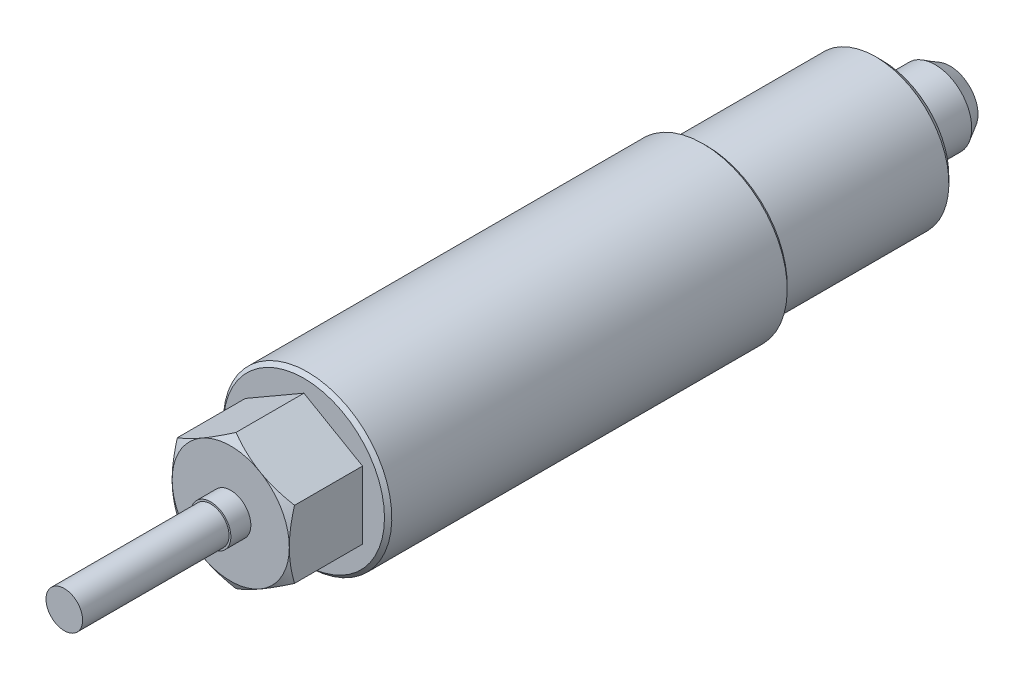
ISO-10303-21;
HEADER;
FILE_DESCRIPTION(('STEP AP214'),'2;1');
FILE_NAME('part.step','',(''),(''),'','','');
FILE_SCHEMA(('AUTOMOTIVE_DESIGN { 1 0 10303 214 1 1 1 1 }'));
ENDSEC;
DATA;
#1=APPLICATION_CONTEXT('core data for automotive mechanical design processes');
#2=APPLICATION_PROTOCOL_DEFINITION('international standard','automotive_design',2000,#1);
#3=PRODUCT_CONTEXT('',#1,'mechanical');
#4=PRODUCT('Part','Part','',(#3));
#5=PRODUCT_RELATED_PRODUCT_CATEGORY('part','',(#4));
#6=PRODUCT_DEFINITION_FORMATION('','',#4);
#7=PRODUCT_DEFINITION_CONTEXT('part definition',#1,'design');
#8=PRODUCT_DEFINITION('design','',#6,#7);
#9=PRODUCT_DEFINITION_SHAPE('','',#8);
#10=(LENGTH_UNIT() NAMED_UNIT(*) SI_UNIT(.MILLI.,.METRE.));
#11=(NAMED_UNIT(*) PLANE_ANGLE_UNIT() SI_UNIT($,.RADIAN.));
#12=(NAMED_UNIT(*) SI_UNIT($,.STERADIAN.) SOLID_ANGLE_UNIT());
#13=UNCERTAINTY_MEASURE_WITH_UNIT(LENGTH_MEASURE(1.E-05),#10,'distance_accuracy_value','');
#14=(GEOMETRIC_REPRESENTATION_CONTEXT(3) GLOBAL_UNCERTAINTY_ASSIGNED_CONTEXT((#13)) GLOBAL_UNIT_ASSIGNED_CONTEXT((#10,
#11,#12)) REPRESENTATION_CONTEXT('',''));
#15=CARTESIAN_POINT('',(0.,0.,0.));
#16=DIRECTION('',(0.,0.,1.));
#17=DIRECTION('',(1.,0.,0.));
#18=AXIS2_PLACEMENT_3D('',#15,#16,#17);
#19=CARTESIAN_POINT('',(0.,0.,79.));
#20=DIRECTION('',(0.,0.,-1.));
#21=DIRECTION('',(0.,1.,0.));
#22=AXIS2_PLACEMENT_3D('',#19,#20,#21);
#23=CONICAL_SURFACE('',#22,11.,0.785398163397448);
#24=CARTESIAN_POINT('',(0.,0.,78.5));
#25=DIRECTION('',(0.,0.,-1.));
#26=DIRECTION('',(0.,1.,0.));
#27=AXIS2_PLACEMENT_3D('',#24,#25,#26);
#28=CIRCLE('',#27,11.5);
#29=CARTESIAN_POINT('',(0.,11.5,78.5));
#30=VERTEX_POINT('',#29);
#31=EDGE_CURVE('E151',#30,#30,#28,.T.);
#32=ORIENTED_EDGE('',*,*,#31,.F.);
#33=EDGE_LOOP('',(#32));
#34=FACE_BOUND('',#33,.T.);
#35=CARTESIAN_POINT('',(0.,0.,79.));
#36=DIRECTION('',(0.,0.,1.));
#37=DIRECTION('',(0.,-1.,0.));
#38=AXIS2_PLACEMENT_3D('',#35,#36,#37);
#39=CIRCLE('',#38,11.);
#40=CARTESIAN_POINT('',(0.,-11.,79.));
#41=VERTEX_POINT('',#40);
#42=EDGE_CURVE('E120',#41,#41,#39,.T.);
#43=ORIENTED_EDGE('',*,*,#42,.F.);
#44=EDGE_LOOP('',(#43));
#45=FACE_BOUND('',#44,.T.);
#46=ADVANCED_FACE('F14',(#34,#45),#23,.T.);
#47=CARTESIAN_POINT('',(0.,0.,0.));
#48=DIRECTION('',(0.,0.,-1.));
#49=DIRECTION('',(0.,1.,0.));
#50=AXIS2_PLACEMENT_3D('',#47,#48,#49);
#51=CYLINDRICAL_SURFACE('',#50,11.5);
#52=CARTESIAN_POINT('',(0.,0.,24.5));
#53=DIRECTION('',(0.,0.,-1.));
#54=DIRECTION('',(0.,1.,0.));
#55=AXIS2_PLACEMENT_3D('',#52,#53,#54);
#56=CIRCLE('',#55,11.5);
#57=CARTESIAN_POINT('',(0.,11.5,24.5));
#58=VERTEX_POINT('',#57);
#59=EDGE_CURVE('E148',#58,#58,#56,.T.);
#60=ORIENTED_EDGE('',*,*,#59,.F.);
#61=EDGE_LOOP('',(#60));
#62=FACE_BOUND('',#61,.T.);
#63=ORIENTED_EDGE('',*,*,#31,.T.);
#64=EDGE_LOOP('',(#63));
#65=FACE_BOUND('',#64,.T.);
#66=ADVANCED_FACE('F218',(#62,#65),#51,.T.);
#67=CARTESIAN_POINT('',(0.,0.,24.5));
#68=DIRECTION('',(0.,0.,1.));
#69=DIRECTION('',(0.,-1.,0.));
#70=AXIS2_PLACEMENT_3D('',#67,#68,#69);
#71=CONICAL_SURFACE('',#70,11.5,0.785398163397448);
#72=CARTESIAN_POINT('',(0.,0.,24.));
#73=DIRECTION('',(0.,0.,-1.));
#74=DIRECTION('',(0.,1.,0.));
#75=AXIS2_PLACEMENT_3D('',#72,#73,#74);
#76=CIRCLE('',#75,11.);
#77=CARTESIAN_POINT('',(0.,11.,24.));
#78=VERTEX_POINT('',#77);
#79=EDGE_CURVE('E145',#78,#78,#76,.T.);
#80=ORIENTED_EDGE('',*,*,#79,.F.);
#81=EDGE_LOOP('',(#80));
#82=FACE_BOUND('',#81,.T.);
#83=ORIENTED_EDGE('',*,*,#59,.T.);
#84=EDGE_LOOP('',(#83));
#85=FACE_BOUND('',#84,.T.);
#86=ADVANCED_FACE('F214',(#82,#85),#71,.T.);
#87=CARTESIAN_POINT('',(11.,0.,24.));
#88=DIRECTION('',(0.,0.,1.));
#89=DIRECTION('',(0.,-1.,0.));
#90=AXIS2_PLACEMENT_3D('',#87,#88,#89);
#91=PLANE('',#90);
#92=CARTESIAN_POINT('',(0.,0.,24.));
#93=DIRECTION('',(0.,0.,-1.));
#94=DIRECTION('',(0.,1.,0.));
#95=AXIS2_PLACEMENT_3D('',#92,#93,#94);
#96=CIRCLE('',#95,10.);
#97=CARTESIAN_POINT('',(0.,10.,24.));
#98=VERTEX_POINT('',#97);
#99=EDGE_CURVE('E142',#98,#98,#96,.T.);
#100=ORIENTED_EDGE('',*,*,#99,.F.);
#101=EDGE_LOOP('',(#100));
#102=FACE_BOUND('',#101,.T.);
#103=ORIENTED_EDGE('',*,*,#79,.T.);
#104=EDGE_LOOP('',(#103));
#105=FACE_BOUND('',#104,.T.);
#106=ADVANCED_FACE('F211',(#102,#105),#91,.F.);
#107=CARTESIAN_POINT('',(-8.,4.61880215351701,79.));
#108=DIRECTION('',(-1.,0.,0.));
#109=DIRECTION('',(0.,-1.,0.));
#110=AXIS2_PLACEMENT_3D('',#107,#108,#109);
#111=PLANE('',#110);
#112=CARTESIAN_POINT('',(-8.,12.5536073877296,85.0243648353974));
#113=CARTESIAN_POINT('',(-8.,12.202944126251,85.1950535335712));
#114=CARTESIAN_POINT('',(-8.,11.851491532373,85.3641476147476));
#115=CARTESIAN_POINT('',(-8.,11.1465884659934,85.6982525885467));
#116=CARTESIAN_POINT('',(-8.,10.7931377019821,85.8632628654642));
#117=CARTESIAN_POINT('',(-8.,10.0820673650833,86.189105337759));
#118=CARTESIAN_POINT('',(-8.,9.72443565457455,86.3499111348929));
#119=CARTESIAN_POINT('',(-8.,9.0063788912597,86.6651358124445));
#120=CARTESIAN_POINT('',(-8.,8.64595396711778,86.8195549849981));
#121=CARTESIAN_POINT('',(-8.,7.90953345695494,87.1253935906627));
#122=CARTESIAN_POINT('',(-8.,7.53342244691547,87.2765365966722));
#123=CARTESIAN_POINT('',(-8.,6.77685561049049,87.5677353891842));
#124=CARTESIAN_POINT('',(-8.,6.39639930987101,87.7077899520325));
#125=CARTESIAN_POINT('',(-8.,5.63119795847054,87.9732419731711));
#126=CARTESIAN_POINT('',(-8.,5.24646288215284,88.0986678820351));
#127=CARTESIAN_POINT('',(-8.,4.47148883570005,88.3309365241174));
#128=CARTESIAN_POINT('',(-8.,4.08125159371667,88.4377849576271));
#129=CARTESIAN_POINT('',(-8.,3.2971932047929,88.6272837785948));
#130=CARTESIAN_POINT('',(-8.,2.90340610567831,88.7100712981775));
#131=CARTESIAN_POINT('',(-8.,2.30902459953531,88.8127022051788));
#132=CARTESIAN_POINT('',(-8.,2.1102670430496,88.8433221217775));
#133=CARTESIAN_POINT('',(-8.,1.71171483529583,88.8967817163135));
#134=CARTESIAN_POINT('',(-8.,1.51192028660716,88.9196221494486));
#135=CARTESIAN_POINT('',(-8.,1.11423554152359,88.9567734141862));
#136=CARTESIAN_POINT('',(-8.,0.916355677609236,88.9711943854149));
#137=CARTESIAN_POINT('',(-8.,0.520162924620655,88.9916487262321));
#138=CARTESIAN_POINT('',(-8.,0.321850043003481,88.9976822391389));
#139=CARTESIAN_POINT('',(-8.,-0.0748530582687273,89.0012171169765));
#140=CARTESIAN_POINT('',(-8.,-0.273243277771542,88.9987184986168));
#141=CARTESIAN_POINT('',(-8.,-0.669738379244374,88.9852520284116));
#142=CARTESIAN_POINT('',(-8.,-0.867843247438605,88.9742837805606));
#143=CARTESIAN_POINT('',(-8.,-1.33957431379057,88.9383175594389));
#144=CARTESIAN_POINT('',(-8.,-1.61291917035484,88.9095444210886));
#145=CARTESIAN_POINT('',(-8.,-2.15766264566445,88.8374103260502));
#146=CARTESIAN_POINT('',(-8.,-2.42906101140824,88.7940475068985));
#147=CARTESIAN_POINT('',(-8.,-3.23998071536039,88.6443668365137));
#148=CARTESIAN_POINT('',(-8.,-3.77594268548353,88.5184813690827));
#149=CARTESIAN_POINT('',(-8.,-4.57753225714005,88.2991318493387));
#150=CARTESIAN_POINT('',(-8.,-4.84728942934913,88.2198813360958));
#151=CARTESIAN_POINT('',(-8.,-5.38418667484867,88.0528836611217));
#152=CARTESIAN_POINT('',(-8.,-5.65132672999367,87.9651364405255));
#153=CARTESIAN_POINT('',(-8.,-6.18306845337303,87.7825750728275));
#154=CARTESIAN_POINT('',(-8.,-6.4476708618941,87.6877630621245));
#155=CARTESIAN_POINT('',(-8.,-6.97466590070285,87.4922140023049));
#156=CARTESIAN_POINT('',(-8.,-7.23705856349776,87.3914770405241));
#157=CARTESIAN_POINT('',(-8.,-7.88051669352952,87.1374262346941));
#158=CARTESIAN_POINT('',(-8.,-8.26047059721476,86.9813014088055));
#159=CARTESIAN_POINT('',(-8.,-9.01691952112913,86.6608599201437));
#160=CARTESIAN_POINT('',(-8.,-9.39341427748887,86.4965426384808));
#161=CARTESIAN_POINT('',(-8.,-10.143629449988,86.1614403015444));
#162=CARTESIAN_POINT('',(-8.,-10.5173490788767,85.9906534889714));
#163=CARTESIAN_POINT('',(-8.,-11.262399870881,85.6439867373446));
#164=CARTESIAN_POINT('',(-8.,-11.6337310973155,85.4681069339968));
#165=CARTESIAN_POINT('',(-8.,-12.3748915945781,85.1120269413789));
#166=CARTESIAN_POINT('',(-8.,-12.7447183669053,84.931821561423));
#167=CARTESIAN_POINT('',(-8.,-13.482727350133,84.5680742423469));
#168=CARTESIAN_POINT('',(-8.,-13.8509095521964,84.3845322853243));
#169=CARTESIAN_POINT('',(-8.,-14.5858360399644,84.0147378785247));
#170=CARTESIAN_POINT('',(-8.,-14.9525805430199,83.8284858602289));
#171=CARTESIAN_POINT('',(-8.,-15.6849051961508,83.4537053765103));
#172=CARTESIAN_POINT('',(-8.,-16.0504853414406,83.2651769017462));
#173=CARTESIAN_POINT('',(-8.,-17.079769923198,82.7309870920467));
#174=CARTESIAN_POINT('',(-8.,-17.7423367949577,82.3831340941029));
#175=CARTESIAN_POINT('',(-8.,-19.0650363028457,81.6827725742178));
#176=CARTESIAN_POINT('',(-8.,-19.7251688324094,81.3302638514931));
#177=CARTESIAN_POINT('',(-8.,-21.0416810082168,80.6227203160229));
#178=CARTESIAN_POINT('',(-8.,-21.6980659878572,80.2676954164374));
#179=CARTESIAN_POINT('',(-8.,-23.0092915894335,79.554901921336));
#180=CARTESIAN_POINT('',(-8.,-23.6641323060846,79.1971335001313));
#181=CARTESIAN_POINT('',(-8.,-24.3184126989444,78.8383511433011));
#182=B_SPLINE_CURVE_WITH_KNOTS('',3,(#112,#113,#114,#115,#116,#117,#118,#119,#120,#121,#122,
#123,#124,#125,#126,#127,#128,#129,#130,#131,#132,#133,#134,#135,#136,#137,#138,#139,#140,#141,
#142,#143,#144,#145,#146,#147,#148,#149,#150,#151,#152,#153,#154,#155,#156,#157,#158,#159,#160,
#161,#162,#163,#164,#165,#166,#167,#168,#169,#170,#171,#172,#173,#174,#175,#176,#177,#178,#179,
#180,#181),.UNSPECIFIED.,.F.,.F.,(4,2,2,2,2,2,2,2,2,2,2,2,2,2,2,2,2,2,2,2,2,2,2,2,2,2,2,2,2,2,2,
2,2,2,4),(0.,1.17001110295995,2.3401975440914,3.51651067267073,4.69276993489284,
5.90866593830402,7.1246959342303,8.33832003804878,9.55157109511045,10.7577653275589,
11.3609441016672,11.9640643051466,12.5591069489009,13.1541394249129,13.7491707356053,
14.3442298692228,15.1683323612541,15.9925400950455,17.6418068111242,18.485205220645,
19.328609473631,20.1717597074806,21.0148975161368,22.2471030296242,23.4794017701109,
24.7120376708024,25.9446407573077,27.1788052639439,28.4129763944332,29.646953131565,
30.8809349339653,33.1258942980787,35.3709507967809,37.6096830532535,39.8482742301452),.UNSPECIFIED.);
#183=CARTESIAN_POINT('',(-8.,-4.61880215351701,88.2854688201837));
#184=VERTEX_POINT('',#183);
#185=CARTESIAN_POINT('',(-8.,0.,89.));
#186=VERTEX_POINT('',#185);
#187=EDGE_CURVE('E9',#184,#186,#182,.F.);
#188=ORIENTED_EDGE('',*,*,#187,.T.);
#189=CARTESIAN_POINT('',(-8.,4.61880215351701,88.2854688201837));
#190=VERTEX_POINT('',#189);
#191=EDGE_CURVE('E18',#186,#190,#182,.F.);
#192=ORIENTED_EDGE('',*,*,#191,.T.);
#193=DIRECTION('',(0.,0.,1.));
#194=VECTOR('',#193,1.);
#195=CARTESIAN_POINT('',(-8.,4.61880215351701,79.));
#196=LINE('',#195,#194);
#197=CARTESIAN_POINT('',(-8.,4.61880215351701,79.));
#198=VERTEX_POINT('',#197);
#199=EDGE_CURVE('E111',#198,#190,#196,.T.);
#200=ORIENTED_EDGE('',*,*,#199,.F.);
#201=DIRECTION('',(0.,-1.,0.));
#202=VECTOR('',#201,1.);
#203=CARTESIAN_POINT('',(-8.,4.61880215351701,79.));
#204=LINE('',#203,#202);
#205=CARTESIAN_POINT('',(-8.,-4.61880215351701,79.));
#206=VERTEX_POINT('',#205);
#207=EDGE_CURVE('E97',#198,#206,#204,.T.);
#208=ORIENTED_EDGE('',*,*,#207,.T.);
#209=DIRECTION('',(0.,0.,1.));
#210=VECTOR('',#209,1.);
#211=CARTESIAN_POINT('',(-8.,-4.61880215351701,79.));
#212=LINE('',#211,#210);
#213=EDGE_CURVE('E89',#206,#184,#212,.T.);
#214=ORIENTED_EDGE('',*,*,#213,.T.);
#215=EDGE_LOOP('',(#188,#192,#200,#208,#214));
#216=FACE_BOUND('',#215,.T.);
#217=ADVANCED_FACE('F110',(#216),#111,.T.);
#218=CARTESIAN_POINT('',(0.,9.23760430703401,79.));
#219=DIRECTION('',(-0.5,0.866025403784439,0.));
#220=DIRECTION('',(-0.866025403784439,-0.5,0.));
#221=AXIS2_PLACEMENT_3D('',#218,#219,#220);
#222=PLANE('',#221);
#223=CARTESIAN_POINT('',(-8.0002,4.61868668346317,88.285402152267));
#224=CARTESIAN_POINT('',(-7.82435121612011,4.72021302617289,88.3440092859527));
#225=CARTESIAN_POINT('',(-7.64784680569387,4.82211789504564,88.3999565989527));
#226=CARTESIAN_POINT('',(-7.29340453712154,5.02675523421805,88.5057989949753));
#227=CARTESIAN_POINT('',(-7.11546609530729,5.12948804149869,88.5556914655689));
#228=CARTESIAN_POINT('',(-6.57880176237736,5.43933133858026,88.6953072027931));
#229=CARTESIAN_POINT('',(-6.21795741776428,5.64766491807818,88.7747188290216));
#230=CARTESIAN_POINT('',(-5.67796082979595,5.95943209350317,88.8678383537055));
#231=CARTESIAN_POINT('',(-5.50042181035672,6.06193429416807,88.8943654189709));
#232=CARTESIAN_POINT('',(-5.1445408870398,6.26740224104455,88.9388468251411));
#233=CARTESIAN_POINT('',(-4.96619905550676,6.37036794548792,88.9568019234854));
#234=CARTESIAN_POINT('',(-4.60920831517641,6.57647664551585,88.9836843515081));
#235=CARTESIAN_POINT('',(-4.4305599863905,6.67961930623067,88.9926219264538));
#236=CARTESIAN_POINT('',(-4.07309829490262,6.88599991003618,89.0012776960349));
#237=CARTESIAN_POINT('',(-3.89428493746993,6.98923785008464,89.0009961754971));
#238=CARTESIAN_POINT('',(-3.55998663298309,7.18224506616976,88.9918549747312));
#239=CARTESIAN_POINT('',(-3.40447809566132,7.27202796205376,88.9841103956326));
#240=CARTESIAN_POINT('',(-3.09382523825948,7.45138347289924,88.9617988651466));
#241=CARTESIAN_POINT('',(-2.93868094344,7.54095607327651,88.9472314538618));
#242=CARTESIAN_POINT('',(-2.47384868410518,7.80932710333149,88.8936393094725));
#243=CARTESIAN_POINT('',(-2.16498351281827,7.98765049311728,88.8447313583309));
#244=CARTESIAN_POINT('',(-1.5439767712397,8.34618890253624,88.7224605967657));
#245=CARTESIAN_POINT('',(-1.23191445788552,8.52635816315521,88.648579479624));
#246=CARTESIAN_POINT('',(-0.612443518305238,8.88400987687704,88.480899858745));
#247=CARTESIAN_POINT('',(-0.305026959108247,9.06149691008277,88.3871407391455));
#248=CARTESIAN_POINT('',(0.000199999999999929,9.23771977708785,88.285402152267));
#249=B_SPLINE_CURVE_WITH_KNOTS('',3,(#223,#224,#225,#226,#227,#228,#229,#230,#231,#232,#233,
#234,#235,#236,#237,#238,#239,#240,#241,#242,#243,#244,#245,#246,#247,#248),.UNSPECIFIED.,.F.,
.F.,(4,2,2,2,2,2,2,2,2,2,2,2,4),(0.,0.633973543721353,1.26821965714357,2.53934712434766,
3.15934343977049,3.77928496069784,4.39852133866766,5.01773858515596,5.5568023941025,
6.09590254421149,7.17487077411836,8.27776850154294,9.37850115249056),.UNSPECIFIED.);
#250=CARTESIAN_POINT('',(-4.,6.92820323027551,89.));
#251=VERTEX_POINT('',#250);
#252=EDGE_CURVE('E257',#190,#251,#249,.T.);
#253=ORIENTED_EDGE('',*,*,#252,.T.);
#254=CARTESIAN_POINT('',(0.,9.23760430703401,88.2854688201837));
#255=VERTEX_POINT('',#254);
#256=EDGE_CURVE('E251',#251,#255,#249,.T.);
#257=ORIENTED_EDGE('',*,*,#256,.T.);
#258=DIRECTION('',(0.,0.,1.));
#259=VECTOR('',#258,1.);
#260=CARTESIAN_POINT('',(0.,9.23760430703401,79.));
#261=LINE('',#260,#259);
#262=CARTESIAN_POINT('',(0.,9.23760430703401,79.));
#263=VERTEX_POINT('',#262);
#264=EDGE_CURVE('E121',#263,#255,#261,.T.);
#265=ORIENTED_EDGE('',*,*,#264,.F.);
#266=DIRECTION('',(-0.866025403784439,-0.5,0.));
#267=VECTOR('',#266,1.);
#268=CARTESIAN_POINT('',(0.,9.23760430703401,79.));
#269=LINE('',#268,#267);
#270=EDGE_CURVE('E113',#263,#198,#269,.T.);
#271=ORIENTED_EDGE('',*,*,#270,.T.);
#272=ORIENTED_EDGE('',*,*,#199,.T.);
#273=EDGE_LOOP('',(#253,#257,#265,#271,#272));
#274=FACE_BOUND('',#273,.T.);
#275=ADVANCED_FACE('F244',(#274),#222,.T.);
#276=CARTESIAN_POINT('',(8.,4.61880215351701,79.));
#277=DIRECTION('',(0.5,0.866025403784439,0.));
#278=DIRECTION('',(-0.866025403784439,0.5,0.));
#279=AXIS2_PLACEMENT_3D('',#276,#277,#278);
#280=PLANE('',#279);
#281=CARTESIAN_POINT('',(-0.0002,9.23771977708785,88.285402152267));
#282=CARTESIAN_POINT('',(0.175648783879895,9.13619343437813,88.3440092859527));
#283=CARTESIAN_POINT('',(0.352153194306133,9.03428856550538,88.3999565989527));
#284=CARTESIAN_POINT('',(0.706595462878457,8.82965122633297,88.5057989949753));
#285=CARTESIAN_POINT('',(0.884533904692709,8.72691841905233,88.5556914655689));
#286=CARTESIAN_POINT('',(1.42119823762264,8.41707512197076,88.6953072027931));
#287=CARTESIAN_POINT('',(1.78204258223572,8.20874154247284,88.7747188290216));
#288=CARTESIAN_POINT('',(2.32203917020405,7.89697436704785,88.8678383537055));
#289=CARTESIAN_POINT('',(2.49957818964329,7.79447216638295,88.8943654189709));
#290=CARTESIAN_POINT('',(2.8554591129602,7.58900421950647,88.9388468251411));
#291=CARTESIAN_POINT('',(3.03380094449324,7.4860385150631,88.9568019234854));
#292=CARTESIAN_POINT('',(3.3907916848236,7.27992981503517,88.9836843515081));
#293=CARTESIAN_POINT('',(3.56944001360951,7.17678715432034,88.9926219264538));
#294=CARTESIAN_POINT('',(3.92690170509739,6.97040655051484,89.0012776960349));
#295=CARTESIAN_POINT('',(4.10571506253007,6.86716861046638,89.0009961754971));
#296=CARTESIAN_POINT('',(4.44001336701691,6.67416139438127,88.9918549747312));
#297=CARTESIAN_POINT('',(4.59552190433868,6.58437849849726,88.9841103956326));
#298=CARTESIAN_POINT('',(4.90617476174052,6.40502298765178,88.9617988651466));
#299=CARTESIAN_POINT('',(5.06131905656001,6.31545038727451,88.9472314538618));
#300=CARTESIAN_POINT('',(5.52615131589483,6.04707935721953,88.8936393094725));
#301=CARTESIAN_POINT('',(5.83501648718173,5.86875596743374,88.8447313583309));
#302=CARTESIAN_POINT('',(6.45602322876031,5.51021755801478,88.7224605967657));
#303=CARTESIAN_POINT('',(6.76808554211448,5.33004829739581,88.648579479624));
#304=CARTESIAN_POINT('',(7.38755648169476,4.97239658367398,88.480899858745));
#305=CARTESIAN_POINT('',(7.69497304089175,4.79490955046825,88.3871407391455));
#306=CARTESIAN_POINT('',(8.0002,4.61868668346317,88.285402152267));
#307=B_SPLINE_CURVE_WITH_KNOTS('',3,(#281,#282,#283,#284,#285,#286,#287,#288,#289,#290,#291,
#292,#293,#294,#295,#296,#297,#298,#299,#300,#301,#302,#303,#304,#305,#306),.UNSPECIFIED.,.F.,
.F.,(4,2,2,2,2,2,2,2,2,2,2,2,4),(0.,0.633973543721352,1.26821965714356,2.53934712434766,
3.1593434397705,3.77928496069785,4.39852133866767,5.01773858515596,5.5568023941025,
6.09590254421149,7.17487077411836,8.27776850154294,9.37850115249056),.UNSPECIFIED.);
#308=CARTESIAN_POINT('',(4.,6.92820323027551,89.));
#309=VERTEX_POINT('',#308);
#310=EDGE_CURVE('E258',#255,#309,#307,.T.);
#311=ORIENTED_EDGE('',*,*,#310,.T.);
#312=CARTESIAN_POINT('',(8.,4.61880215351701,88.2854688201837));
#313=VERTEX_POINT('',#312);
#314=EDGE_CURVE('E259',#309,#313,#307,.T.);
#315=ORIENTED_EDGE('',*,*,#314,.T.);
#316=DIRECTION('',(0.,0.,1.));
#317=VECTOR('',#316,1.);
#318=CARTESIAN_POINT('',(8.,4.61880215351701,79.));
#319=LINE('',#318,#317);
#320=CARTESIAN_POINT('',(8.,4.61880215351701,79.));
#321=VERTEX_POINT('',#320);
#322=EDGE_CURVE('E124',#321,#313,#319,.T.);
#323=ORIENTED_EDGE('',*,*,#322,.F.);
#324=DIRECTION('',(-0.866025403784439,0.5,0.));
#325=VECTOR('',#324,1.);
#326=CARTESIAN_POINT('',(8.,4.61880215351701,79.));
#327=LINE('',#326,#325);
#328=EDGE_CURVE('E115',#321,#263,#327,.T.);
#329=ORIENTED_EDGE('',*,*,#328,.T.);
#330=ORIENTED_EDGE('',*,*,#264,.T.);
#331=EDGE_LOOP('',(#311,#315,#323,#329,#330));
#332=FACE_BOUND('',#331,.T.);
#333=ADVANCED_FACE('F248',(#332),#280,.T.);
#334=CARTESIAN_POINT('',(8.,-4.61880215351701,79.));
#335=DIRECTION('',(1.,0.,0.));
#336=DIRECTION('',(0.,1.,0.));
#337=AXIS2_PLACEMENT_3D('',#334,#335,#336);
#338=PLANE('',#337);
#339=CARTESIAN_POINT('',(8.,12.5536073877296,85.0243648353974));
#340=CARTESIAN_POINT('',(8.,12.202944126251,85.1950535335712));
#341=CARTESIAN_POINT('',(8.,11.851491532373,85.3641476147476));
#342=CARTESIAN_POINT('',(8.,11.1465884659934,85.6982525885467));
#343=CARTESIAN_POINT('',(8.,10.7931377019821,85.8632628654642));
#344=CARTESIAN_POINT('',(8.,10.0820673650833,86.189105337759));
#345=CARTESIAN_POINT('',(8.,9.72443565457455,86.3499111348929));
#346=CARTESIAN_POINT('',(8.,9.0063788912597,86.6651358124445));
#347=CARTESIAN_POINT('',(8.,8.64595396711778,86.8195549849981));
#348=CARTESIAN_POINT('',(8.,7.90953345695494,87.1253935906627));
#349=CARTESIAN_POINT('',(8.,7.53342244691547,87.2765365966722));
#350=CARTESIAN_POINT('',(8.,6.77685561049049,87.5677353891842));
#351=CARTESIAN_POINT('',(8.,6.39639930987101,87.7077899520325));
#352=CARTESIAN_POINT('',(8.,5.63119795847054,87.9732419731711));
#353=CARTESIAN_POINT('',(8.,5.24646288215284,88.0986678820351));
#354=CARTESIAN_POINT('',(8.,4.47148883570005,88.3309365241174));
#355=CARTESIAN_POINT('',(8.,4.08125159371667,88.4377849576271));
#356=CARTESIAN_POINT('',(8.,3.2971932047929,88.6272837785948));
#357=CARTESIAN_POINT('',(8.,2.90340610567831,88.7100712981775));
#358=CARTESIAN_POINT('',(8.,2.30902459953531,88.8127022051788));
#359=CARTESIAN_POINT('',(8.,2.1102670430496,88.8433221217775));
#360=CARTESIAN_POINT('',(8.,1.71171483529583,88.8967817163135));
#361=CARTESIAN_POINT('',(8.,1.51192028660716,88.9196221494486));
#362=CARTESIAN_POINT('',(8.,1.11423554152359,88.9567734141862));
#363=CARTESIAN_POINT('',(8.,0.916355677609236,88.9711943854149));
#364=CARTESIAN_POINT('',(8.,0.520162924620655,88.9916487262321));
#365=CARTESIAN_POINT('',(8.,0.321850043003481,88.9976822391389));
#366=CARTESIAN_POINT('',(8.,-0.0748530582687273,89.0012171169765));
#367=CARTESIAN_POINT('',(8.,-0.273243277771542,88.9987184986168));
#368=CARTESIAN_POINT('',(8.,-0.669738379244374,88.9852520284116));
#369=CARTESIAN_POINT('',(8.,-0.867843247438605,88.9742837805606));
#370=CARTESIAN_POINT('',(8.,-1.33957431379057,88.9383175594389));
#371=CARTESIAN_POINT('',(8.,-1.61291917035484,88.9095444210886));
#372=CARTESIAN_POINT('',(8.,-2.15766264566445,88.8374103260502));
#373=CARTESIAN_POINT('',(8.,-2.42906101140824,88.7940475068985));
#374=CARTESIAN_POINT('',(8.,-3.23998071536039,88.6443668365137));
#375=CARTESIAN_POINT('',(8.,-3.77594268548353,88.5184813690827));
#376=CARTESIAN_POINT('',(8.,-4.57753225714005,88.2991318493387));
#377=CARTESIAN_POINT('',(8.,-4.84728942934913,88.2198813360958));
#378=CARTESIAN_POINT('',(8.,-5.38418667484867,88.0528836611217));
#379=CARTESIAN_POINT('',(8.,-5.65132672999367,87.9651364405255));
#380=CARTESIAN_POINT('',(8.,-6.18306845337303,87.7825750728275));
#381=CARTESIAN_POINT('',(8.,-6.4476708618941,87.6877630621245));
#382=CARTESIAN_POINT('',(8.,-6.97466590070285,87.4922140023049));
#383=CARTESIAN_POINT('',(8.,-7.23705856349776,87.3914770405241));
#384=CARTESIAN_POINT('',(8.,-7.88051669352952,87.1374262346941));
#385=CARTESIAN_POINT('',(8.,-8.26047059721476,86.9813014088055));
#386=CARTESIAN_POINT('',(8.,-9.01691952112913,86.6608599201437));
#387=CARTESIAN_POINT('',(8.,-9.39341427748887,86.4965426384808));
#388=CARTESIAN_POINT('',(8.,-10.143629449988,86.1614403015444));
#389=CARTESIAN_POINT('',(8.,-10.5173490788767,85.9906534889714));
#390=CARTESIAN_POINT('',(8.,-11.262399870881,85.6439867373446));
#391=CARTESIAN_POINT('',(8.,-11.6337310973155,85.4681069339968));
#392=CARTESIAN_POINT('',(8.,-12.3748915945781,85.1120269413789));
#393=CARTESIAN_POINT('',(8.,-12.7447183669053,84.931821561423));
#394=CARTESIAN_POINT('',(8.,-13.482727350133,84.5680742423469));
#395=CARTESIAN_POINT('',(8.,-13.8509095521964,84.3845322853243));
#396=CARTESIAN_POINT('',(8.,-14.5858360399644,84.0147378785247));
#397=CARTESIAN_POINT('',(8.,-14.9525805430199,83.8284858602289));
#398=CARTESIAN_POINT('',(8.,-15.6849051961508,83.4537053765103));
#399=CARTESIAN_POINT('',(8.,-16.0504853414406,83.2651769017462));
#400=CARTESIAN_POINT('',(8.,-17.079769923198,82.7309870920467));
#401=CARTESIAN_POINT('',(8.,-17.7423367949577,82.3831340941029));
#402=CARTESIAN_POINT('',(8.,-19.0650363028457,81.6827725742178));
#403=CARTESIAN_POINT('',(8.,-19.7251688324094,81.3302638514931));
#404=CARTESIAN_POINT('',(8.,-21.0416810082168,80.6227203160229));
#405=CARTESIAN_POINT('',(8.,-21.6980659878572,80.2676954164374));
#406=CARTESIAN_POINT('',(8.,-23.0092915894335,79.554901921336));
#407=CARTESIAN_POINT('',(8.,-23.6641323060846,79.1971335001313));
#408=CARTESIAN_POINT('',(8.,-24.3184126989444,78.8383511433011));
#409=B_SPLINE_CURVE_WITH_KNOTS('',3,(#339,#340,#341,#342,#343,#344,#345,#346,#347,#348,#349,
#350,#351,#352,#353,#354,#355,#356,#357,#358,#359,#360,#361,#362,#363,#364,#365,#366,#367,#368,
#369,#370,#371,#372,#373,#374,#375,#376,#377,#378,#379,#380,#381,#382,#383,#384,#385,#386,#387,
#388,#389,#390,#391,#392,#393,#394,#395,#396,#397,#398,#399,#400,#401,#402,#403,#404,#405,#406,
#407,#408),.UNSPECIFIED.,.F.,.F.,(4,2,2,2,2,2,2,2,2,2,2,2,2,2,2,2,2,2,2,2,2,2,2,2,2,2,2,2,2,2,2,
2,2,2,4),(0.,1.17001110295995,2.3401975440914,3.51651067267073,4.69276993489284,
5.90866593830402,7.1246959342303,8.33832003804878,9.55157109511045,10.7577653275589,
11.3609441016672,11.9640643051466,12.5591069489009,13.1541394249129,13.7491707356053,
14.3442298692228,15.1683323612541,15.9925400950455,17.6418068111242,18.485205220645,
19.328609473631,20.1717597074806,21.0148975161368,22.2471030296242,23.4794017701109,
24.7120376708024,25.9446407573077,27.1788052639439,28.4129763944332,29.646953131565,
30.8809349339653,33.1258942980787,35.3709507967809,37.6096830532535,39.8482742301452),.UNSPECIFIED.);
#410=CARTESIAN_POINT('',(8.,0.,89.));
#411=VERTEX_POINT('',#410);
#412=EDGE_CURVE('E264',#313,#411,#409,.T.);
#413=ORIENTED_EDGE('',*,*,#412,.T.);
#414=CARTESIAN_POINT('',(8.,-4.61880215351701,88.2854688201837));
#415=VERTEX_POINT('',#414);
#416=EDGE_CURVE('E265',#411,#415,#409,.T.);
#417=ORIENTED_EDGE('',*,*,#416,.T.);
#418=DIRECTION('',(0.,0.,1.));
#419=VECTOR('',#418,1.);
#420=CARTESIAN_POINT('',(8.,-4.61880215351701,79.));
#421=LINE('',#420,#419);
#422=CARTESIAN_POINT('',(8.,-4.61880215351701,79.));
#423=VERTEX_POINT('',#422);
#424=EDGE_CURVE('E127',#423,#415,#421,.T.);
#425=ORIENTED_EDGE('',*,*,#424,.F.);
#426=DIRECTION('',(0.,1.,0.));
#427=VECTOR('',#426,1.);
#428=CARTESIAN_POINT('',(8.,-4.61880215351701,79.));
#429=LINE('',#428,#427);
#430=EDGE_CURVE('E319',#423,#321,#429,.T.);
#431=ORIENTED_EDGE('',*,*,#430,.T.);
#432=ORIENTED_EDGE('',*,*,#322,.T.);
#433=EDGE_LOOP('',(#413,#417,#425,#431,#432));
#434=FACE_BOUND('',#433,.T.);
#435=ADVANCED_FACE('F271',(#434),#338,.T.);
#436=CARTESIAN_POINT('',(0.,-9.23760430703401,79.));
#437=DIRECTION('',(0.5,-0.866025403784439,0.));
#438=DIRECTION('',(0.866025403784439,0.5,0.));
#439=AXIS2_PLACEMENT_3D('',#436,#437,#438);
#440=PLANE('',#439);
#441=CARTESIAN_POINT('',(8.0002,-4.61868668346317,88.285402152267));
#442=CARTESIAN_POINT('',(7.82435121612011,-4.72021302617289,88.3440092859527));
#443=CARTESIAN_POINT('',(7.64784680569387,-4.82211789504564,88.3999565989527));
#444=CARTESIAN_POINT('',(7.29340453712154,-5.02675523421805,88.5057989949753));
#445=CARTESIAN_POINT('',(7.11546609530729,-5.12948804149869,88.5556914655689));
#446=CARTESIAN_POINT('',(6.57880176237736,-5.43933133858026,88.6953072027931));
#447=CARTESIAN_POINT('',(6.21795741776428,-5.64766491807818,88.7747188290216));
#448=CARTESIAN_POINT('',(5.67796082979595,-5.95943209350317,88.8678383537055));
#449=CARTESIAN_POINT('',(5.50042181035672,-6.06193429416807,88.8943654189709));
#450=CARTESIAN_POINT('',(5.1445408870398,-6.26740224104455,88.9388468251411));
#451=CARTESIAN_POINT('',(4.96619905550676,-6.37036794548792,88.9568019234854));
#452=CARTESIAN_POINT('',(4.60920831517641,-6.57647664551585,88.9836843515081));
#453=CARTESIAN_POINT('',(4.4305599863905,-6.67961930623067,88.9926219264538));
#454=CARTESIAN_POINT('',(4.07309829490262,-6.88599991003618,89.0012776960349));
#455=CARTESIAN_POINT('',(3.89428493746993,-6.98923785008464,89.0009961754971));
#456=CARTESIAN_POINT('',(3.55998663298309,-7.18224506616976,88.9918549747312));
#457=CARTESIAN_POINT('',(3.40447809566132,-7.27202796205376,88.9841103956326));
#458=CARTESIAN_POINT('',(3.09382523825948,-7.45138347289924,88.9617988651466));
#459=CARTESIAN_POINT('',(2.93868094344,-7.54095607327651,88.9472314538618));
#460=CARTESIAN_POINT('',(2.47384868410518,-7.80932710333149,88.8936393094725));
#461=CARTESIAN_POINT('',(2.16498351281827,-7.98765049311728,88.8447313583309));
#462=CARTESIAN_POINT('',(1.5439767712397,-8.34618890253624,88.7224605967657));
#463=CARTESIAN_POINT('',(1.23191445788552,-8.52635816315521,88.648579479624));
#464=CARTESIAN_POINT('',(0.612443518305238,-8.88400987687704,88.480899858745));
#465=CARTESIAN_POINT('',(0.305026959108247,-9.06149691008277,88.3871407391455));
#466=CARTESIAN_POINT('',(-0.000199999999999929,-9.23771977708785,88.285402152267));
#467=B_SPLINE_CURVE_WITH_KNOTS('',3,(#441,#442,#443,#444,#445,#446,#447,#448,#449,#450,#451,
#452,#453,#454,#455,#456,#457,#458,#459,#460,#461,#462,#463,#464,#465,#466),.UNSPECIFIED.,.F.,
.F.,(4,2,2,2,2,2,2,2,2,2,2,2,4),(0.,0.633973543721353,1.26821965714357,2.53934712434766,
3.15934343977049,3.77928496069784,4.39852133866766,5.01773858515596,5.5568023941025,
6.09590254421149,7.17487077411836,8.27776850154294,9.37850115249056),.UNSPECIFIED.);
#468=CARTESIAN_POINT('',(4.,-6.92820323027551,89.));
#469=VERTEX_POINT('',#468);
#470=EDGE_CURVE('E270',#415,#469,#467,.T.);
#471=ORIENTED_EDGE('',*,*,#470,.T.);
#472=CARTESIAN_POINT('',(0.,-9.23760430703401,88.2854688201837));
#473=VERTEX_POINT('',#472);
#474=EDGE_CURVE('E177',#469,#473,#467,.T.);
#475=ORIENTED_EDGE('',*,*,#474,.T.);
#476=DIRECTION('',(0.,0.,1.));
#477=VECTOR('',#476,1.);
#478=CARTESIAN_POINT('',(0.,-9.23760430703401,79.));
#479=LINE('',#478,#477);
#480=CARTESIAN_POINT('',(0.,-9.23760430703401,79.));
#481=VERTEX_POINT('',#480);
#482=EDGE_CURVE('E96',#481,#473,#479,.T.);
#483=ORIENTED_EDGE('',*,*,#482,.F.);
#484=DIRECTION('',(0.866025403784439,0.5,0.));
#485=VECTOR('',#484,1.);
#486=CARTESIAN_POINT('',(0.,-9.23760430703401,79.));
#487=LINE('',#486,#485);
#488=EDGE_CURVE('E107',#481,#423,#487,.T.);
#489=ORIENTED_EDGE('',*,*,#488,.T.);
#490=ORIENTED_EDGE('',*,*,#424,.T.);
#491=EDGE_LOOP('',(#471,#475,#483,#489,#490));
#492=FACE_BOUND('',#491,.T.);
#493=ADVANCED_FACE('F191',(#492),#440,.T.);
#494=CARTESIAN_POINT('',(-8.,-4.61880215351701,79.));
#495=DIRECTION('',(-0.5,-0.866025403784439,0.));
#496=DIRECTION('',(0.866025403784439,-0.5,0.));
#497=AXIS2_PLACEMENT_3D('',#494,#495,#496);
#498=PLANE('',#497);
#499=CARTESIAN_POINT('',(0.0002,-9.23771977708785,88.285402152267));
#500=CARTESIAN_POINT('',(-0.175648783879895,-9.13619343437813,88.3440092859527));
#501=CARTESIAN_POINT('',(-0.352153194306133,-9.03428856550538,88.3999565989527));
#502=CARTESIAN_POINT('',(-0.706595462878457,-8.82965122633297,88.5057989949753));
#503=CARTESIAN_POINT('',(-0.884533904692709,-8.72691841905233,88.5556914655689));
#504=CARTESIAN_POINT('',(-1.42119823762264,-8.41707512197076,88.6953072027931));
#505=CARTESIAN_POINT('',(-1.78204258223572,-8.20874154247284,88.7747188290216));
#506=CARTESIAN_POINT('',(-2.32203917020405,-7.89697436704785,88.8678383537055));
#507=CARTESIAN_POINT('',(-2.49957818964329,-7.79447216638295,88.8943654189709));
#508=CARTESIAN_POINT('',(-2.8554591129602,-7.58900421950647,88.9388468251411));
#509=CARTESIAN_POINT('',(-3.03380094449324,-7.4860385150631,88.9568019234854));
#510=CARTESIAN_POINT('',(-3.3907916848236,-7.27992981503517,88.9836843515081));
#511=CARTESIAN_POINT('',(-3.56944001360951,-7.17678715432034,88.9926219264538));
#512=CARTESIAN_POINT('',(-3.92690170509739,-6.97040655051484,89.0012776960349));
#513=CARTESIAN_POINT('',(-4.10571506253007,-6.86716861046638,89.0009961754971));
#514=CARTESIAN_POINT('',(-4.44001336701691,-6.67416139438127,88.9918549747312));
#515=CARTESIAN_POINT('',(-4.59552190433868,-6.58437849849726,88.9841103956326));
#516=CARTESIAN_POINT('',(-4.90617476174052,-6.40502298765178,88.9617988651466));
#517=CARTESIAN_POINT('',(-5.06131905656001,-6.31545038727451,88.9472314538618));
#518=CARTESIAN_POINT('',(-5.52615131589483,-6.04707935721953,88.8936393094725));
#519=CARTESIAN_POINT('',(-5.83501648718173,-5.86875596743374,88.8447313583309));
#520=CARTESIAN_POINT('',(-6.45602322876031,-5.51021755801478,88.7224605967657));
#521=CARTESIAN_POINT('',(-6.76808554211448,-5.33004829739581,88.648579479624));
#522=CARTESIAN_POINT('',(-7.38755648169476,-4.97239658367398,88.480899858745));
#523=CARTESIAN_POINT('',(-7.69497304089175,-4.79490955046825,88.3871407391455));
#524=CARTESIAN_POINT('',(-8.0002,-4.61868668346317,88.285402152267));
#525=B_SPLINE_CURVE_WITH_KNOTS('',3,(#499,#500,#501,#502,#503,#504,#505,#506,#507,#508,#509,
#510,#511,#512,#513,#514,#515,#516,#517,#518,#519,#520,#521,#522,#523,#524),.UNSPECIFIED.,.F.,
.F.,(4,2,2,2,2,2,2,2,2,2,2,2,4),(0.,0.633973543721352,1.26821965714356,2.53934712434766,
3.1593434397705,3.77928496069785,4.39852133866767,5.01773858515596,5.5568023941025,
6.09590254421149,7.17487077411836,8.27776850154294,9.37850115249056),.UNSPECIFIED.);
#526=CARTESIAN_POINT('',(-4.,-6.92820323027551,89.));
#527=VERTEX_POINT('',#526);
#528=EDGE_CURVE('E35',#473,#527,#525,.T.);
#529=ORIENTED_EDGE('',*,*,#528,.T.);
#530=EDGE_CURVE('E93',#527,#184,#525,.T.);
#531=ORIENTED_EDGE('',*,*,#530,.T.);
#532=ORIENTED_EDGE('',*,*,#213,.F.);
#533=DIRECTION('',(0.866025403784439,-0.5,0.));
#534=VECTOR('',#533,1.);
#535=CARTESIAN_POINT('',(-8.,-4.61880215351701,79.));
#536=LINE('',#535,#534);
#537=EDGE_CURVE('E92',#206,#481,#536,.T.);
#538=ORIENTED_EDGE('',*,*,#537,.T.);
#539=ORIENTED_EDGE('',*,*,#482,.T.);
#540=EDGE_LOOP('',(#529,#531,#532,#538,#539));
#541=FACE_BOUND('',#540,.T.);
#542=ADVANCED_FACE('F91',(#541),#498,.T.);
#543=CARTESIAN_POINT('',(0.,0.,79.));
#544=DIRECTION('',(0.,0.,1.));
#545=DIRECTION('',(0.,-1.,0.));
#546=AXIS2_PLACEMENT_3D('',#543,#544,#545);
#547=PLANE('',#546);
#548=ORIENTED_EDGE('',*,*,#207,.F.);
#549=ORIENTED_EDGE('',*,*,#270,.F.);
#550=ORIENTED_EDGE('',*,*,#328,.F.);
#551=ORIENTED_EDGE('',*,*,#430,.F.);
#552=ORIENTED_EDGE('',*,*,#488,.F.);
#553=ORIENTED_EDGE('',*,*,#537,.F.);
#554=EDGE_LOOP('',(#548,#549,#550,#551,#552,#553));
#555=FACE_BOUND('',#554,.T.);
#556=ORIENTED_EDGE('',*,*,#42,.T.);
#557=EDGE_LOOP('',(#556));
#558=FACE_BOUND('',#557,.T.);
#559=ADVANCED_FACE('F102',(#555,#558),#547,.T.);
#560=CARTESIAN_POINT('',(0.,0.,111.73));
#561=DIRECTION('',(0.,0.,-1.));
#562=DIRECTION('',(0.,1.,0.));
#563=AXIS2_PLACEMENT_3D('',#560,#561,#562);
#564=PLANE('',#563);
#565=CARTESIAN_POINT('',(0.,0.,111.73));
#566=DIRECTION('',(0.,0.,-1.));
#567=DIRECTION('',(0.,1.,0.));
#568=AXIS2_PLACEMENT_3D('',#565,#566,#567);
#569=CIRCLE('',#568,2.5);
#570=CARTESIAN_POINT('',(0.,2.5,111.73));
#571=VERTEX_POINT('',#570);
#572=EDGE_CURVE('E168',#571,#571,#569,.T.);
#573=ORIENTED_EDGE('',*,*,#572,.F.);
#574=EDGE_LOOP('',(#573));
#575=FACE_BOUND('',#574,.T.);
#576=ADVANCED_FACE('F16',(#575),#564,.F.);
#577=CARTESIAN_POINT('',(0.,0.,0.));
#578=DIRECTION('',(0.,0.,-1.));
#579=DIRECTION('',(0.,1.,0.));
#580=AXIS2_PLACEMENT_3D('',#577,#578,#579);
#581=CYLINDRICAL_SURFACE('',#580,2.5);
#582=CARTESIAN_POINT('',(0.,0.,91.73));
#583=DIRECTION('',(0.,0.,-1.));
#584=DIRECTION('',(0.,1.,0.));
#585=AXIS2_PLACEMENT_3D('',#582,#583,#584);
#586=CIRCLE('',#585,2.5);
#587=CARTESIAN_POINT('',(0.,2.5,91.73));
#588=VERTEX_POINT('',#587);
#589=EDGE_CURVE('E165',#588,#588,#586,.T.);
#590=ORIENTED_EDGE('',*,*,#589,.F.);
#591=EDGE_LOOP('',(#590));
#592=FACE_BOUND('',#591,.T.);
#593=ORIENTED_EDGE('',*,*,#572,.T.);
#594=EDGE_LOOP('',(#593));
#595=FACE_BOUND('',#594,.T.);
#596=ADVANCED_FACE('F237',(#592,#595),#581,.T.);
#597=CARTESIAN_POINT('',(2.5,0.,91.73));
#598=DIRECTION('',(0.,0.,-1.));
#599=DIRECTION('',(0.,1.,0.));
#600=AXIS2_PLACEMENT_3D('',#597,#598,#599);
#601=PLANE('',#600);
#602=CARTESIAN_POINT('',(0.,0.,91.73));
#603=DIRECTION('',(0.,0.,-1.));
#604=DIRECTION('',(0.,1.,0.));
#605=AXIS2_PLACEMENT_3D('',#602,#603,#604);
#606=CIRCLE('',#605,2.75);
#607=CARTESIAN_POINT('',(0.,2.75,91.73));
#608=VERTEX_POINT('',#607);
#609=EDGE_CURVE('E162',#608,#608,#606,.T.);
#610=ORIENTED_EDGE('',*,*,#609,.F.);
#611=EDGE_LOOP('',(#610));
#612=FACE_BOUND('',#611,.T.);
#613=ORIENTED_EDGE('',*,*,#589,.T.);
#614=EDGE_LOOP('',(#613));
#615=FACE_BOUND('',#614,.T.);
#616=ADVANCED_FACE('F591',(#612,#615),#601,.F.);
#617=CARTESIAN_POINT('',(0.,0.,0.));
#618=DIRECTION('',(0.,0.,-1.));
#619=DIRECTION('',(0.,1.,0.));
#620=AXIS2_PLACEMENT_3D('',#617,#618,#619);
#621=CYLINDRICAL_SURFACE('',#620,2.75);
#622=CARTESIAN_POINT('',(0.,0.,89.));
#623=DIRECTION('',(0.,0.,-1.));
#624=DIRECTION('',(0.,1.,0.));
#625=AXIS2_PLACEMENT_3D('',#622,#623,#624);
#626=CIRCLE('',#625,2.75);
#627=CARTESIAN_POINT('',(0.,2.75,89.));
#628=VERTEX_POINT('',#627);
#629=EDGE_CURVE('E158',#628,#628,#626,.T.);
#630=ORIENTED_EDGE('',*,*,#629,.F.);
#631=EDGE_LOOP('',(#630));
#632=FACE_BOUND('',#631,.T.);
#633=ORIENTED_EDGE('',*,*,#609,.T.);
#634=EDGE_LOOP('',(#633));
#635=FACE_BOUND('',#634,.T.);
#636=ADVANCED_FACE('F584',(#632,#635),#621,.T.);
#637=CARTESIAN_POINT('',(0.,0.,89.));
#638=DIRECTION('',(0.,0.,-1.));
#639=DIRECTION('',(0.,1.,0.));
#640=AXIS2_PLACEMENT_3D('',#637,#638,#639);
#641=CONICAL_SURFACE('',#640,8.,1.0471975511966);
#642=ORIENTED_EDGE('',*,*,#416,.F.);
#643=CARTESIAN_POINT('',(0.,0.,89.));
#644=DIRECTION('',(0.,0.,-1.));
#645=DIRECTION('',(0.,1.,0.));
#646=AXIS2_PLACEMENT_3D('',#643,#644,#645);
#647=CIRCLE('',#646,8.);
#648=EDGE_CURVE('E155',#411,#469,#647,.T.);
#649=ORIENTED_EDGE('',*,*,#648,.T.);
#650=ORIENTED_EDGE('',*,*,#470,.F.);
#651=EDGE_LOOP('',(#642,#649,#650));
#652=FACE_BOUND('',#651,.T.);
#653=ADVANCED_FACE('F290',(#652),#641,.T.);
#654=ORIENTED_EDGE('',*,*,#474,.F.);
#655=EDGE_CURVE('E159',#469,#527,#647,.T.);
#656=ORIENTED_EDGE('',*,*,#655,.T.);
#657=ORIENTED_EDGE('',*,*,#528,.F.);
#658=EDGE_LOOP('',(#654,#656,#657));
#659=FACE_BOUND('',#658,.T.);
#660=ADVANCED_FACE('F547',(#659),#641,.T.);
#661=ORIENTED_EDGE('',*,*,#191,.F.);
#662=EDGE_CURVE('E308',#186,#251,#647,.T.);
#663=ORIENTED_EDGE('',*,*,#662,.T.);
#664=ORIENTED_EDGE('',*,*,#252,.F.);
#665=EDGE_LOOP('',(#661,#663,#664));
#666=FACE_BOUND('',#665,.T.);
#667=ADVANCED_FACE('F546',(#666),#641,.T.);
#668=ORIENTED_EDGE('',*,*,#256,.F.);
#669=EDGE_CURVE('E297',#251,#309,#647,.T.);
#670=ORIENTED_EDGE('',*,*,#669,.T.);
#671=ORIENTED_EDGE('',*,*,#310,.F.);
#672=EDGE_LOOP('',(#668,#670,#671));
#673=FACE_BOUND('',#672,.T.);
#674=ADVANCED_FACE('F316',(#673),#641,.T.);
#675=ORIENTED_EDGE('',*,*,#314,.F.);
#676=EDGE_CURVE('E154',#309,#411,#647,.T.);
#677=ORIENTED_EDGE('',*,*,#676,.T.);
#678=ORIENTED_EDGE('',*,*,#412,.F.);
#679=EDGE_LOOP('',(#675,#677,#678));
#680=FACE_BOUND('',#679,.T.);
#681=ADVANCED_FACE('F293',(#680),#641,.T.);
#682=CARTESIAN_POINT('',(2.75,0.,89.));
#683=DIRECTION('',(0.,0.,-1.));
#684=DIRECTION('',(0.,1.,0.));
#685=AXIS2_PLACEMENT_3D('',#682,#683,#684);
#686=PLANE('',#685);
#687=ORIENTED_EDGE('',*,*,#648,.F.);
#688=ORIENTED_EDGE('',*,*,#676,.F.);
#689=ORIENTED_EDGE('',*,*,#669,.F.);
#690=ORIENTED_EDGE('',*,*,#662,.F.);
#691=EDGE_CURVE('E305',#527,#186,#647,.T.);
#692=ORIENTED_EDGE('',*,*,#691,.F.);
#693=ORIENTED_EDGE('',*,*,#655,.F.);
#694=EDGE_LOOP('',(#687,#688,#689,#690,#692,#693));
#695=FACE_BOUND('',#694,.T.);
#696=ORIENTED_EDGE('',*,*,#629,.T.);
#697=EDGE_LOOP('',(#696));
#698=FACE_BOUND('',#697,.T.);
#699=ADVANCED_FACE('F299',(#695,#698),#686,.F.);
#700=ORIENTED_EDGE('',*,*,#187,.F.);
#701=ORIENTED_EDGE('',*,*,#530,.F.);
#702=ORIENTED_EDGE('',*,*,#691,.T.);
#703=EDGE_LOOP('',(#700,#701,#702));
#704=FACE_BOUND('',#703,.T.);
#705=ADVANCED_FACE('F184',(#704),#641,.T.);
#706=CARTESIAN_POINT('',(0.,0.,0.));
#707=DIRECTION('',(0.,0.,-1.));
#708=DIRECTION('',(-1.,0.,0.));
#709=AXIS2_PLACEMENT_3D('',#706,#707,#708);
#710=SPHERICAL_SURFACE('',#709,10.);
#711=CARTESIAN_POINT('',(0.,0.,-9.24093444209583));
#712=DIRECTION('',(0.,0.,-1.));
#713=DIRECTION('',(0.,1.,0.));
#714=AXIS2_PLACEMENT_3D('',#711,#712,#713);
#715=CIRCLE('',#714,3.82166595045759);
#716=CARTESIAN_POINT('',(0.,3.82166595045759,-9.24093444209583));
#717=VERTEX_POINT('',#716);
#718=EDGE_CURVE('E343',#717,#717,#715,.T.);
#719=ORIENTED_EDGE('',*,*,#718,.T.);
#720=EDGE_LOOP('',(#719));
#721=FACE_BOUND('',#720,.T.);
#722=ADVANCED_FACE('F347',(#721),#710,.T.);
#723=CARTESIAN_POINT('',(0.,0.,-7.2));
#724=DIRECTION('',(0.,0.,1.));
#725=DIRECTION('',(0.,-1.,0.));
#726=AXIS2_PLACEMENT_3D('',#723,#724,#725);
#727=CONICAL_SURFACE('',#726,5.,0.523598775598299);
#728=ORIENTED_EDGE('',*,*,#718,.F.);
#729=EDGE_LOOP('',(#728));
#730=FACE_BOUND('',#729,.T.);
#731=CARTESIAN_POINT('',(0.,0.,-7.2));
#732=DIRECTION('',(0.,0.,-1.));
#733=DIRECTION('',(0.,1.,0.));
#734=AXIS2_PLACEMENT_3D('',#731,#732,#733);
#735=CIRCLE('',#734,5.);
#736=CARTESIAN_POINT('',(0.,5.,-7.2));
#737=VERTEX_POINT('',#736);
#738=EDGE_CURVE('E340',#737,#737,#735,.T.);
#739=ORIENTED_EDGE('',*,*,#738,.T.);
#740=EDGE_LOOP('',(#739));
#741=FACE_BOUND('',#740,.T.);
#742=ADVANCED_FACE('F349',(#730,#741),#727,.T.);
#743=CARTESIAN_POINT('',(0.,0.,-10.));
#744=DIRECTION('',(0.,0.,-1.));
#745=DIRECTION('',(0.,1.,0.));
#746=AXIS2_PLACEMENT_3D('',#743,#744,#745);
#747=CYLINDRICAL_SURFACE('',#746,5.);
#748=ORIENTED_EDGE('',*,*,#738,.F.);
#749=EDGE_LOOP('',(#748));
#750=FACE_BOUND('',#749,.T.);
#751=CARTESIAN_POINT('',(0.,0.,-0.5));
#752=DIRECTION('',(0.,0.,-1.));
#753=DIRECTION('',(0.,1.,0.));
#754=AXIS2_PLACEMENT_3D('',#751,#752,#753);
#755=CIRCLE('',#754,5.);
#756=CARTESIAN_POINT('',(0.,5.,-0.5));
#757=VERTEX_POINT('',#756);
#758=EDGE_CURVE('E337',#757,#757,#755,.T.);
#759=ORIENTED_EDGE('',*,*,#758,.T.);
#760=EDGE_LOOP('',(#759));
#761=FACE_BOUND('',#760,.T.);
#762=ADVANCED_FACE('F352',(#750,#761),#747,.T.);
#763=CARTESIAN_POINT('',(0.,0.,-0.326794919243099));
#764=DIRECTION('',(0.,0.,-1.));
#765=DIRECTION('',(0.,1.,0.));
#766=AXIS2_PLACEMENT_3D('',#763,#764,#765);
#767=CONICAL_SURFACE('',#766,4.9,0.523598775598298);
#768=ORIENTED_EDGE('',*,*,#758,.F.);
#769=EDGE_LOOP('',(#768));
#770=FACE_BOUND('',#769,.T.);
#771=CARTESIAN_POINT('',(0.,0.,-0.326794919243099));
#772=DIRECTION('',(0.,0.,-1.));
#773=DIRECTION('',(0.,1.,0.));
#774=AXIS2_PLACEMENT_3D('',#771,#772,#773);
#775=CIRCLE('',#774,4.9);
#776=CARTESIAN_POINT('',(0.,4.9,-0.326794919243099));
#777=VERTEX_POINT('',#776);
#778=EDGE_CURVE('E334',#777,#777,#775,.T.);
#779=ORIENTED_EDGE('',*,*,#778,.T.);
#780=EDGE_LOOP('',(#779));
#781=FACE_BOUND('',#780,.T.);
#782=ADVANCED_FACE('F358',(#770,#781),#767,.T.);
#783=CARTESIAN_POINT('',(0.,0.,-10.));
#784=DIRECTION('',(0.,0.,-1.));
#785=DIRECTION('',(0.,1.,0.));
#786=AXIS2_PLACEMENT_3D('',#783,#784,#785);
#787=CYLINDRICAL_SURFACE('',#786,4.9);
#788=ORIENTED_EDGE('',*,*,#778,.F.);
#789=EDGE_LOOP('',(#788));
#790=FACE_BOUND('',#789,.T.);
#791=CARTESIAN_POINT('',(0.,0.,-0.25));
#792=DIRECTION('',(0.,0.,-1.));
#793=DIRECTION('',(0.,1.,0.));
#794=AXIS2_PLACEMENT_3D('',#791,#792,#793);
#795=CIRCLE('',#794,4.9);
#796=CARTESIAN_POINT('',(0.,4.9,-0.25));
#797=VERTEX_POINT('',#796);
#798=EDGE_CURVE('E331',#797,#797,#795,.T.);
#799=ORIENTED_EDGE('',*,*,#798,.T.);
#800=EDGE_LOOP('',(#799));
#801=FACE_BOUND('',#800,.T.);
#802=ADVANCED_FACE('F364',(#790,#801),#787,.T.);
#803=CARTESIAN_POINT('',(0.,0.,-0.25));
#804=DIRECTION('',(0.,0.,-1.));
#805=DIRECTION('',(0.,1.,0.));
#806=AXIS2_PLACEMENT_3D('',#803,#804,#805);
#807=TOROIDAL_SURFACE('',#806,5.15,0.25);
#808=ORIENTED_EDGE('',*,*,#798,.F.);
#809=EDGE_LOOP('',(#808));
#810=FACE_BOUND('',#809,.T.);
#811=CARTESIAN_POINT('',(0.,0.,0.));
#812=DIRECTION('',(0.,0.,-1.));
#813=DIRECTION('',(0.,1.,0.));
#814=AXIS2_PLACEMENT_3D('',#811,#812,#813);
#815=CIRCLE('',#814,5.15);
#816=CARTESIAN_POINT('',(0.,5.15,0.));
#817=VERTEX_POINT('',#816);
#818=EDGE_CURVE('E328',#817,#817,#815,.T.);
#819=ORIENTED_EDGE('',*,*,#818,.T.);
#820=EDGE_LOOP('',(#819));
#821=FACE_BOUND('',#820,.T.);
#822=ADVANCED_FACE('F370',(#810,#821),#807,.F.);
#823=CARTESIAN_POINT('',(5.2,0.,0.));
#824=DIRECTION('',(0.,0.,1.));
#825=DIRECTION('',(0.,-1.,0.));
#826=AXIS2_PLACEMENT_3D('',#823,#824,#825);
#827=PLANE('',#826);
#828=ORIENTED_EDGE('',*,*,#818,.F.);
#829=EDGE_LOOP('',(#828));
#830=FACE_BOUND('',#829,.T.);
#831=CARTESIAN_POINT('',(0.,0.,0.));
#832=DIRECTION('',(0.,0.,-1.));
#833=DIRECTION('',(0.,1.,0.));
#834=AXIS2_PLACEMENT_3D('',#831,#832,#833);
#835=CIRCLE('',#834,5.2);
#836=CARTESIAN_POINT('',(0.,5.2,0.));
#837=VERTEX_POINT('',#836);
#838=EDGE_CURVE('E325',#837,#837,#835,.T.);
#839=ORIENTED_EDGE('',*,*,#838,.T.);
#840=EDGE_LOOP('',(#839));
#841=FACE_BOUND('',#840,.T.);
#842=ADVANCED_FACE('F376',(#830,#841),#827,.F.);
#843=CARTESIAN_POINT('',(0.,0.,0.3));
#844=DIRECTION('',(0.,0.,1.));
#845=DIRECTION('',(0.,-1.,0.));
#846=AXIS2_PLACEMENT_3D('',#843,#844,#845);
#847=CONICAL_SURFACE('',#846,5.5,0.785398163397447);
#848=ORIENTED_EDGE('',*,*,#838,.F.);
#849=EDGE_LOOP('',(#848));
#850=FACE_BOUND('',#849,.T.);
#851=CARTESIAN_POINT('',(0.,0.,0.3));
#852=DIRECTION('',(0.,0.,-1.));
#853=DIRECTION('',(0.,1.,0.));
#854=AXIS2_PLACEMENT_3D('',#851,#852,#853);
#855=CIRCLE('',#854,5.5);
#856=CARTESIAN_POINT('',(0.,5.5,0.3));
#857=VERTEX_POINT('',#856);
#858=EDGE_CURVE('E108',#857,#857,#855,.T.);
#859=ORIENTED_EDGE('',*,*,#858,.T.);
#860=EDGE_LOOP('',(#859));
#861=FACE_BOUND('',#860,.T.);
#862=ADVANCED_FACE('F198',(#850,#861),#847,.T.);
#863=CARTESIAN_POINT('',(0.,0.,0.));
#864=DIRECTION('',(0.,0.,-1.));
#865=DIRECTION('',(0.,1.,0.));
#866=AXIS2_PLACEMENT_3D('',#863,#864,#865);
#867=CYLINDRICAL_SURFACE('',#866,5.5);
#868=ORIENTED_EDGE('',*,*,#858,.F.);
#869=EDGE_LOOP('',(#868));
#870=FACE_BOUND('',#869,.T.);
#871=CARTESIAN_POINT('',(0.,0.,0.));
#872=DIRECTION('',(0.,0.,-1.));
#873=DIRECTION('',(0.,1.,0.));
#874=AXIS2_PLACEMENT_3D('',#871,#872,#873);
#875=CIRCLE('',#874,5.5);
#876=CARTESIAN_POINT('',(0.,5.5,0.));
#877=VERTEX_POINT('',#876);
#878=EDGE_CURVE('E133',#877,#877,#875,.T.);
#879=ORIENTED_EDGE('',*,*,#878,.T.);
#880=EDGE_LOOP('',(#879));
#881=FACE_BOUND('',#880,.T.);
#882=ADVANCED_FACE('F194',(#870,#881),#867,.F.);
#883=CARTESIAN_POINT('',(9.08,0.,0.));
#884=DIRECTION('',(0.,0.,1.));
#885=DIRECTION('',(0.,-1.,0.));
#886=AXIS2_PLACEMENT_3D('',#883,#884,#885);
#887=PLANE('',#886);
#888=ORIENTED_EDGE('',*,*,#878,.F.);
#889=EDGE_LOOP('',(#888));
#890=FACE_BOUND('',#889,.T.);
#891=CARTESIAN_POINT('',(0.,0.,0.));
#892=DIRECTION('',(0.,0.,-1.));
#893=DIRECTION('',(0.,1.,0.));
#894=AXIS2_PLACEMENT_3D('',#891,#892,#893);
#895=CIRCLE('',#894,9.08);
#896=CARTESIAN_POINT('',(0.,9.08,0.));
#897=VERTEX_POINT('',#896);
#898=EDGE_CURVE('E136',#897,#897,#895,.T.);
#899=ORIENTED_EDGE('',*,*,#898,.T.);
#900=EDGE_LOOP('',(#899));
#901=FACE_BOUND('',#900,.T.);
#902=ADVANCED_FACE('F197',(#890,#901),#887,.F.);
#903=CARTESIAN_POINT('',(0.,0.,0.92));
#904=DIRECTION('',(0.,0.,1.));
#905=DIRECTION('',(0.,-1.,0.));
#906=AXIS2_PLACEMENT_3D('',#903,#904,#905);
#907=CONICAL_SURFACE('',#906,10.,0.785398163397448);
#908=ORIENTED_EDGE('',*,*,#898,.F.);
#909=EDGE_LOOP('',(#908));
#910=FACE_BOUND('',#909,.T.);
#911=CARTESIAN_POINT('',(0.,0.,0.92));
#912=DIRECTION('',(0.,0.,-1.));
#913=DIRECTION('',(0.,1.,0.));
#914=AXIS2_PLACEMENT_3D('',#911,#912,#913);
#915=CIRCLE('',#914,10.);
#916=CARTESIAN_POINT('',(0.,10.,0.92));
#917=VERTEX_POINT('',#916);
#918=EDGE_CURVE('E139',#917,#917,#915,.T.);
#919=ORIENTED_EDGE('',*,*,#918,.T.);
#920=EDGE_LOOP('',(#919));
#921=FACE_BOUND('',#920,.T.);
#922=ADVANCED_FACE('F202',(#910,#921),#907,.T.);
#923=CARTESIAN_POINT('',(0.,0.,0.));
#924=DIRECTION('',(0.,0.,-1.));
#925=DIRECTION('',(0.,1.,0.));
#926=AXIS2_PLACEMENT_3D('',#923,#924,#925);
#927=CYLINDRICAL_SURFACE('',#926,10.);
#928=ORIENTED_EDGE('',*,*,#918,.F.);
#929=EDGE_LOOP('',(#928));
#930=FACE_BOUND('',#929,.T.);
#931=ORIENTED_EDGE('',*,*,#99,.T.);
#932=EDGE_LOOP('',(#931));
#933=FACE_BOUND('',#932,.T.);
#934=ADVANCED_FACE('F206',(#930,#933),#927,.T.);
#935=CLOSED_SHELL('',(#46,#66,#86,#106,#217,#275,#333,#435,#493,#542,#559,#576,#596,#616,#636,
#653,#660,#667,#674,#681,#699,#705,#722,#742,#762,#782,#802,#822,#842,#862,#882,#902,#922,#934));
#936=MANIFOLD_SOLID_BREP('B1',#935);
#937=ADVANCED_BREP_SHAPE_REPRESENTATION('',(#18,#936),#14);
#938=SHAPE_DEFINITION_REPRESENTATION(#9,#937);
ENDSEC;
END-ISO-10303-21;
